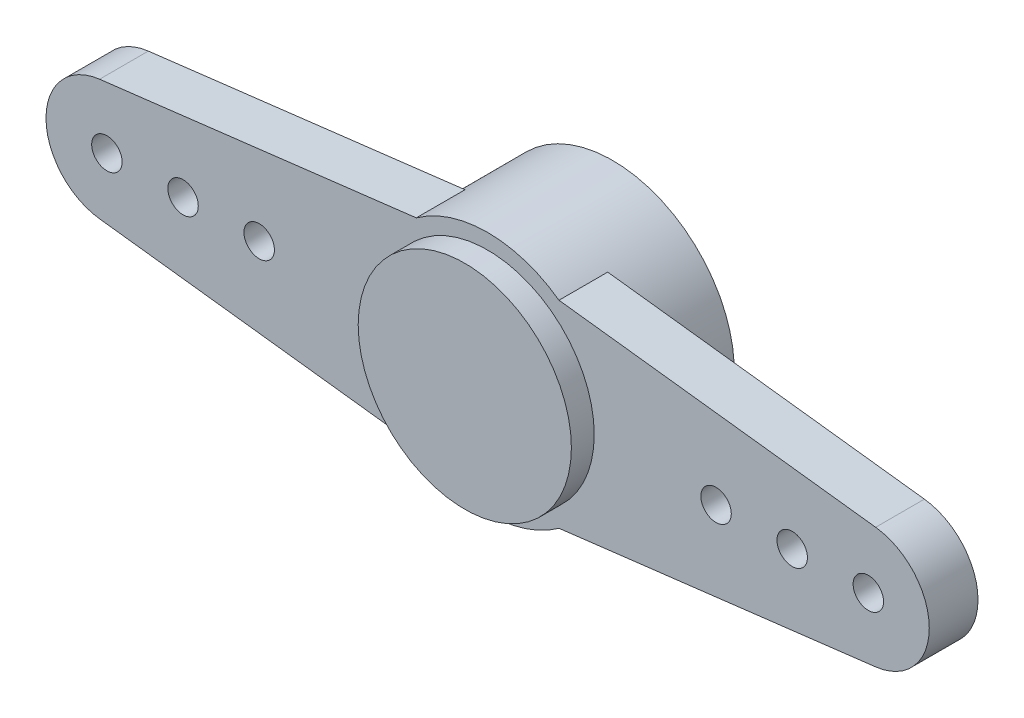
ISO-10303-21;
HEADER;
FILE_DESCRIPTION(('STEP AP214'),'2;1');
FILE_NAME('part.step','',(''),(''),'','','');
FILE_SCHEMA(('AUTOMOTIVE_DESIGN { 1 0 10303 214 1 1 1 1 }'));
ENDSEC;
DATA;
#1=APPLICATION_CONTEXT('core data for automotive mechanical design processes');
#2=APPLICATION_PROTOCOL_DEFINITION('international standard','automotive_design',2000,#1);
#3=PRODUCT_CONTEXT('',#1,'mechanical');
#4=PRODUCT('Part','Part','',(#3));
#5=PRODUCT_RELATED_PRODUCT_CATEGORY('part','',(#4));
#6=PRODUCT_DEFINITION_FORMATION('','',#4);
#7=PRODUCT_DEFINITION_CONTEXT('part definition',#1,'design');
#8=PRODUCT_DEFINITION('design','',#6,#7);
#9=PRODUCT_DEFINITION_SHAPE('','',#8);
#10=(LENGTH_UNIT() NAMED_UNIT(*) SI_UNIT(.MILLI.,.METRE.));
#11=(NAMED_UNIT(*) PLANE_ANGLE_UNIT() SI_UNIT($,.RADIAN.));
#12=(NAMED_UNIT(*) SI_UNIT($,.STERADIAN.) SOLID_ANGLE_UNIT());
#13=UNCERTAINTY_MEASURE_WITH_UNIT(LENGTH_MEASURE(1.E-05),#10,'distance_accuracy_value','');
#14=(GEOMETRIC_REPRESENTATION_CONTEXT(3) GLOBAL_UNCERTAINTY_ASSIGNED_CONTEXT((#13)) GLOBAL_UNIT_ASSIGNED_CONTEXT((#10,
#11,#12)) REPRESENTATION_CONTEXT('',''));
#15=CARTESIAN_POINT('',(0.,0.,0.));
#16=DIRECTION('',(0.,0.,1.));
#17=DIRECTION('',(1.,0.,0.));
#18=AXIS2_PLACEMENT_3D('',#15,#16,#17);
#19=CARTESIAN_POINT('',(0.,0.,0.));
#20=DIRECTION('',(0.,0.,1.));
#21=DIRECTION('',(1.,0.,0.));
#22=AXIS2_PLACEMENT_3D('',#19,#20,#21);
#23=PLANE('',#22);
#24=CARTESIAN_POINT('',(-10.,0.,0.));
#25=DIRECTION('',(0.,0.,1.));
#26=DIRECTION('',(1.,0.,0.));
#27=AXIS2_PLACEMENT_3D('',#24,#25,#26);
#28=CIRCLE('',#27,0.500000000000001);
#29=CARTESIAN_POINT('',(-9.5,0.,0.));
#30=VERTEX_POINT('',#29);
#31=EDGE_CURVE('E212',#30,#30,#28,.T.);
#32=ORIENTED_EDGE('',*,*,#31,.T.);
#33=EDGE_LOOP('',(#32));
#34=FACE_BOUND('',#33,.T.);
#35=CARTESIAN_POINT('',(-12.5,0.,0.));
#36=DIRECTION('',(0.,0.,1.));
#37=DIRECTION('',(1.,0.,0.));
#38=AXIS2_PLACEMENT_3D('',#35,#36,#37);
#39=CIRCLE('',#38,0.500000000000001);
#40=CARTESIAN_POINT('',(-12.,0.,0.));
#41=VERTEX_POINT('',#40);
#42=EDGE_CURVE('E218',#41,#41,#39,.T.);
#43=ORIENTED_EDGE('',*,*,#42,.T.);
#44=EDGE_LOOP('',(#43));
#45=FACE_BOUND('',#44,.T.);
#46=CARTESIAN_POINT('',(-7.5,0.,0.));
#47=DIRECTION('',(0.,0.,1.));
#48=DIRECTION('',(1.,0.,0.));
#49=AXIS2_PLACEMENT_3D('',#46,#47,#48);
#50=CIRCLE('',#49,0.500000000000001);
#51=CARTESIAN_POINT('',(-7.,0.,0.));
#52=VERTEX_POINT('',#51);
#53=EDGE_CURVE('E206',#52,#52,#50,.T.);
#54=ORIENTED_EDGE('',*,*,#53,.T.);
#55=EDGE_LOOP('',(#54));
#56=FACE_BOUND('',#55,.T.);
#57=DIRECTION('',(-0.992773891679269,-0.12,0.));
#58=VECTOR('',#57,1.);
#59=CARTESIAN_POINT('',(-12.74,1.98554778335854,0.));
#60=LINE('',#59,#58);
#61=CARTESIAN_POINT('',(-2.34249837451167,3.242329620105,0.));
#62=VERTEX_POINT('',#61);
#63=CARTESIAN_POINT('',(-12.74,1.98554778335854,0.));
#64=VERTEX_POINT('',#63);
#65=EDGE_CURVE('E134',#62,#64,#60,.T.);
#66=ORIENTED_EDGE('',*,*,#65,.F.);
#67=CARTESIAN_POINT('',(0.,0.,0.));
#68=DIRECTION('',(0.,0.,1.));
#69=DIRECTION('',(1.,0.,0.));
#70=AXIS2_PLACEMENT_3D('',#67,#68,#69);
#71=CIRCLE('',#70,4.);
#72=CARTESIAN_POINT('',(-2.34249837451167,-3.242329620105,0.));
#73=VERTEX_POINT('',#72);
#74=EDGE_CURVE('E120',#62,#73,#71,.T.);
#75=ORIENTED_EDGE('',*,*,#74,.T.);
#76=DIRECTION('',(0.992773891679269,-0.12,0.));
#77=VECTOR('',#76,1.);
#78=CARTESIAN_POINT('',(-12.74,-1.98554778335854,0.));
#79=LINE('',#78,#77);
#80=CARTESIAN_POINT('',(-12.74,-1.98554778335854,0.));
#81=VERTEX_POINT('',#80);
#82=EDGE_CURVE('E127',#81,#73,#79,.T.);
#83=ORIENTED_EDGE('',*,*,#82,.F.);
#84=CARTESIAN_POINT('',(-12.5,0.,0.));
#85=DIRECTION('',(0.,0.,1.));
#86=DIRECTION('',(1.,0.,0.));
#87=AXIS2_PLACEMENT_3D('',#84,#85,#86);
#88=CIRCLE('',#87,2.);
#89=EDGE_CURVE('E81',#64,#81,#88,.T.);
#90=ORIENTED_EDGE('',*,*,#89,.F.);
#91=EDGE_LOOP('',(#66,#75,#83,#90));
#92=FACE_BOUND('',#91,.T.);
#93=ADVANCED_FACE('F34',(#34,#45,#56,#92),#23,.F.);
#94=CARTESIAN_POINT('',(0.,0.,1.6));
#95=DIRECTION('',(0.,0.,1.));
#96=DIRECTION('',(1.,0.,0.));
#97=AXIS2_PLACEMENT_3D('',#94,#95,#96);
#98=PLANE('',#97);
#99=DIRECTION('',(-0.992773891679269,0.12,0.));
#100=VECTOR('',#99,1.);
#101=CARTESIAN_POINT('',(0.42,3.47470862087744,1.6));
#102=LINE('',#101,#100);
#103=CARTESIAN_POINT('',(12.74,1.98554778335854,1.6));
#104=VERTEX_POINT('',#103);
#105=CARTESIAN_POINT('',(2.34249837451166,3.242329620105,1.6));
#106=VERTEX_POINT('',#105);
#107=EDGE_CURVE('E128',#104,#106,#102,.T.);
#108=ORIENTED_EDGE('',*,*,#107,.T.);
#109=CARTESIAN_POINT('',(0.,0.,1.6));
#110=DIRECTION('',(0.,0.,1.));
#111=DIRECTION('',(1.,0.,0.));
#112=AXIS2_PLACEMENT_3D('',#109,#110,#111);
#113=CIRCLE('',#112,4.);
#114=CARTESIAN_POINT('',(-2.34249837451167,3.242329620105,1.6));
#115=VERTEX_POINT('',#114);
#116=EDGE_CURVE('E121',#115,#106,#113,.F.);
#117=ORIENTED_EDGE('',*,*,#116,.F.);
#118=DIRECTION('',(-0.992773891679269,-0.12,0.));
#119=VECTOR('',#118,1.);
#120=CARTESIAN_POINT('',(-12.74,1.98554778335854,1.6));
#121=LINE('',#120,#119);
#122=CARTESIAN_POINT('',(-12.74,1.98554778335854,1.6));
#123=VERTEX_POINT('',#122);
#124=EDGE_CURVE('E149',#115,#123,#121,.T.);
#125=ORIENTED_EDGE('',*,*,#124,.T.);
#126=CARTESIAN_POINT('',(-12.5,0.,1.6));
#127=DIRECTION('',(0.,0.,1.));
#128=DIRECTION('',(1.,0.,0.));
#129=AXIS2_PLACEMENT_3D('',#126,#127,#128);
#130=CIRCLE('',#129,2.);
#131=CARTESIAN_POINT('',(-12.74,-1.98554778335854,1.6));
#132=VERTEX_POINT('',#131);
#133=EDGE_CURVE('E60',#123,#132,#130,.T.);
#134=ORIENTED_EDGE('',*,*,#133,.T.);
#135=DIRECTION('',(0.992773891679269,-0.12,0.));
#136=VECTOR('',#135,1.);
#137=CARTESIAN_POINT('',(-12.74,-1.98554778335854,1.6));
#138=LINE('',#137,#136);
#139=CARTESIAN_POINT('',(-2.34249837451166,-3.242329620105,1.6));
#140=VERTEX_POINT('',#139);
#141=EDGE_CURVE('E119',#132,#140,#138,.T.);
#142=ORIENTED_EDGE('',*,*,#141,.T.);
#143=CARTESIAN_POINT('',(2.34249837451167,-3.242329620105,1.6));
#144=VERTEX_POINT('',#143);
#145=EDGE_CURVE('E52',#144,#140,#113,.F.);
#146=ORIENTED_EDGE('',*,*,#145,.F.);
#147=DIRECTION('',(0.992773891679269,0.12,0.));
#148=VECTOR('',#147,1.);
#149=CARTESIAN_POINT('',(12.74,-1.98554778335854,1.6));
#150=LINE('',#149,#148);
#151=CARTESIAN_POINT('',(12.74,-1.98554778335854,1.6));
#152=VERTEX_POINT('',#151);
#153=EDGE_CURVE('E38',#144,#152,#150,.T.);
#154=ORIENTED_EDGE('',*,*,#153,.T.);
#155=CARTESIAN_POINT('',(12.5,0.,1.6));
#156=DIRECTION('',(0.,0.,1.));
#157=DIRECTION('',(1.,0.,0.));
#158=AXIS2_PLACEMENT_3D('',#155,#156,#157);
#159=CIRCLE('',#158,2.);
#160=EDGE_CURVE('E126',#152,#104,#159,.T.);
#161=ORIENTED_EDGE('',*,*,#160,.T.);
#162=EDGE_LOOP('',(#108,#117,#125,#134,#142,#146,#154,#161));
#163=FACE_BOUND('',#162,.T.);
#164=CARTESIAN_POINT('',(10.,0.,1.6));
#165=DIRECTION('',(0.,0.,1.));
#166=DIRECTION('',(1.,0.,0.));
#167=AXIS2_PLACEMENT_3D('',#164,#165,#166);
#168=CIRCLE('',#167,0.500000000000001);
#169=CARTESIAN_POINT('',(10.5,0.,1.6));
#170=VERTEX_POINT('',#169);
#171=EDGE_CURVE('E197',#170,#170,#168,.T.);
#172=ORIENTED_EDGE('',*,*,#171,.F.);
#173=EDGE_LOOP('',(#172));
#174=FACE_BOUND('',#173,.T.);
#175=CARTESIAN_POINT('',(7.5,0.,1.6));
#176=DIRECTION('',(0.,0.,1.));
#177=DIRECTION('',(1.,0.,0.));
#178=AXIS2_PLACEMENT_3D('',#175,#176,#177);
#179=CIRCLE('',#178,0.500000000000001);
#180=CARTESIAN_POINT('',(8.,0.,1.6));
#181=VERTEX_POINT('',#180);
#182=EDGE_CURVE('E203',#181,#181,#179,.T.);
#183=ORIENTED_EDGE('',*,*,#182,.F.);
#184=EDGE_LOOP('',(#183));
#185=FACE_BOUND('',#184,.T.);
#186=CARTESIAN_POINT('',(12.5,0.,1.6));
#187=DIRECTION('',(0.,0.,1.));
#188=DIRECTION('',(1.,0.,0.));
#189=AXIS2_PLACEMENT_3D('',#186,#187,#188);
#190=CIRCLE('',#189,0.500000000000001);
#191=CARTESIAN_POINT('',(13.,0.,1.6));
#192=VERTEX_POINT('',#191);
#193=EDGE_CURVE('E191',#192,#192,#190,.T.);
#194=ORIENTED_EDGE('',*,*,#193,.F.);
#195=EDGE_LOOP('',(#194));
#196=FACE_BOUND('',#195,.T.);
#197=CARTESIAN_POINT('',(0.,0.,1.6));
#198=DIRECTION('',(0.,0.,1.));
#199=DIRECTION('',(1.,0.,0.));
#200=AXIS2_PLACEMENT_3D('',#197,#198,#199);
#201=CIRCLE('',#200,3.5);
#202=CARTESIAN_POINT('',(3.5,0.,1.6));
#203=VERTEX_POINT('',#202);
#204=EDGE_CURVE('E44',#203,#203,#201,.T.);
#205=ORIENTED_EDGE('',*,*,#204,.F.);
#206=EDGE_LOOP('',(#205));
#207=FACE_BOUND('',#206,.T.);
#208=CARTESIAN_POINT('',(-10.,0.,1.6));
#209=DIRECTION('',(0.,0.,1.));
#210=DIRECTION('',(1.,0.,0.));
#211=AXIS2_PLACEMENT_3D('',#208,#209,#210);
#212=CIRCLE('',#211,0.500000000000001);
#213=CARTESIAN_POINT('',(-9.5,0.,1.6));
#214=VERTEX_POINT('',#213);
#215=EDGE_CURVE('E215',#214,#214,#212,.T.);
#216=ORIENTED_EDGE('',*,*,#215,.F.);
#217=EDGE_LOOP('',(#216));
#218=FACE_BOUND('',#217,.T.);
#219=CARTESIAN_POINT('',(-12.5,0.,1.6));
#220=DIRECTION('',(0.,0.,1.));
#221=DIRECTION('',(1.,0.,0.));
#222=AXIS2_PLACEMENT_3D('',#219,#220,#221);
#223=CIRCLE('',#222,0.500000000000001);
#224=CARTESIAN_POINT('',(-12.,0.,1.6));
#225=VERTEX_POINT('',#224);
#226=EDGE_CURVE('E166',#225,#225,#223,.T.);
#227=ORIENTED_EDGE('',*,*,#226,.F.);
#228=EDGE_LOOP('',(#227));
#229=FACE_BOUND('',#228,.T.);
#230=CARTESIAN_POINT('',(-7.5,0.,1.6));
#231=DIRECTION('',(0.,0.,1.));
#232=DIRECTION('',(1.,0.,0.));
#233=AXIS2_PLACEMENT_3D('',#230,#231,#232);
#234=CIRCLE('',#233,0.500000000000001);
#235=CARTESIAN_POINT('',(-7.,0.,1.6));
#236=VERTEX_POINT('',#235);
#237=EDGE_CURVE('E209',#236,#236,#234,.T.);
#238=ORIENTED_EDGE('',*,*,#237,.F.);
#239=EDGE_LOOP('',(#238));
#240=FACE_BOUND('',#239,.T.);
#241=ADVANCED_FACE('F116',(#163,#174,#185,#196,#207,#218,#229,#240),#98,.T.);
#242=CARTESIAN_POINT('',(10.,0.,0.));
#243=DIRECTION('',(0.,0.,1.));
#244=DIRECTION('',(1.,0.,0.));
#245=AXIS2_PLACEMENT_3D('',#242,#243,#244);
#246=CIRCLE('',#245,0.500000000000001);
#247=CARTESIAN_POINT('',(10.5,0.,0.));
#248=VERTEX_POINT('',#247);
#249=EDGE_CURVE('E194',#248,#248,#246,.T.);
#250=ORIENTED_EDGE('',*,*,#249,.T.);
#251=EDGE_LOOP('',(#250));
#252=FACE_BOUND('',#251,.T.);
#253=DIRECTION('',(0.992773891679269,0.12,0.));
#254=VECTOR('',#253,1.);
#255=CARTESIAN_POINT('',(12.74,-1.98554778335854,0.));
#256=LINE('',#255,#254);
#257=CARTESIAN_POINT('',(2.34249837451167,-3.242329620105,0.));
#258=VERTEX_POINT('',#257);
#259=CARTESIAN_POINT('',(12.74,-1.98554778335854,0.));
#260=VERTEX_POINT('',#259);
#261=EDGE_CURVE('E163',#258,#260,#256,.T.);
#262=ORIENTED_EDGE('',*,*,#261,.F.);
#263=CARTESIAN_POINT('',(2.34249837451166,3.242329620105,0.));
#264=VERTEX_POINT('',#263);
#265=EDGE_CURVE('E110',#258,#264,#71,.T.);
#266=ORIENTED_EDGE('',*,*,#265,.T.);
#267=DIRECTION('',(-0.992773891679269,0.12,0.));
#268=VECTOR('',#267,1.);
#269=CARTESIAN_POINT('',(0.42,3.47470862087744,0.));
#270=LINE('',#269,#268);
#271=CARTESIAN_POINT('',(12.74,1.98554778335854,0.));
#272=VERTEX_POINT('',#271);
#273=EDGE_CURVE('E168',#272,#264,#270,.T.);
#274=ORIENTED_EDGE('',*,*,#273,.F.);
#275=CARTESIAN_POINT('',(12.5,0.,0.));
#276=DIRECTION('',(0.,0.,1.));
#277=DIRECTION('',(1.,0.,0.));
#278=AXIS2_PLACEMENT_3D('',#275,#276,#277);
#279=CIRCLE('',#278,2.);
#280=EDGE_CURVE('E165',#260,#272,#279,.T.);
#281=ORIENTED_EDGE('',*,*,#280,.F.);
#282=EDGE_LOOP('',(#262,#266,#274,#281));
#283=FACE_BOUND('',#282,.T.);
#284=CARTESIAN_POINT('',(7.5,0.,0.));
#285=DIRECTION('',(0.,0.,1.));
#286=DIRECTION('',(1.,0.,0.));
#287=AXIS2_PLACEMENT_3D('',#284,#285,#286);
#288=CIRCLE('',#287,0.500000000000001);
#289=CARTESIAN_POINT('',(8.,0.,0.));
#290=VERTEX_POINT('',#289);
#291=EDGE_CURVE('E200',#290,#290,#288,.T.);
#292=ORIENTED_EDGE('',*,*,#291,.T.);
#293=EDGE_LOOP('',(#292));
#294=FACE_BOUND('',#293,.T.);
#295=CARTESIAN_POINT('',(12.5,0.,0.));
#296=DIRECTION('',(0.,0.,1.));
#297=DIRECTION('',(1.,0.,0.));
#298=AXIS2_PLACEMENT_3D('',#295,#296,#297);
#299=CIRCLE('',#298,0.500000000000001);
#300=CARTESIAN_POINT('',(13.,0.,0.));
#301=VERTEX_POINT('',#300);
#302=EDGE_CURVE('E190',#301,#301,#299,.T.);
#303=ORIENTED_EDGE('',*,*,#302,.T.);
#304=EDGE_LOOP('',(#303));
#305=FACE_BOUND('',#304,.T.);
#306=ADVANCED_FACE('F245',(#252,#283,#294,#305),#23,.F.);
#307=CARTESIAN_POINT('',(12.74,-1.98554778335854,1.6));
#308=DIRECTION('',(-0.12,0.992773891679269,0.));
#309=DIRECTION('',(-0.992773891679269,-0.12,0.));
#310=AXIS2_PLACEMENT_3D('',#307,#308,#309);
#311=PLANE('',#310);
#312=ORIENTED_EDGE('',*,*,#153,.F.);
#313=DIRECTION('',(0.,0.,-1.));
#314=VECTOR('',#313,1.);
#315=CARTESIAN_POINT('',(2.34249837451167,-3.242329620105,12.9137084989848));
#316=LINE('',#315,#314);
#317=EDGE_CURVE('E107',#144,#258,#316,.T.);
#318=ORIENTED_EDGE('',*,*,#317,.T.);
#319=ORIENTED_EDGE('',*,*,#261,.T.);
#320=DIRECTION('',(0.,0.,-1.));
#321=VECTOR('',#320,1.);
#322=CARTESIAN_POINT('',(12.74,-1.98554778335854,1.6));
#323=LINE('',#322,#321);
#324=EDGE_CURVE('E124',#152,#260,#323,.T.);
#325=ORIENTED_EDGE('',*,*,#324,.F.);
#326=EDGE_LOOP('',(#312,#318,#319,#325));
#327=FACE_BOUND('',#326,.T.);
#328=ADVANCED_FACE('F36',(#327),#311,.F.);
#329=CARTESIAN_POINT('',(12.5,0.,1.6));
#330=DIRECTION('',(0.,0.,-1.));
#331=DIRECTION('',(-1.,0.,0.));
#332=AXIS2_PLACEMENT_3D('',#329,#330,#331);
#333=CYLINDRICAL_SURFACE('',#332,2.);
#334=ORIENTED_EDGE('',*,*,#280,.T.);
#335=DIRECTION('',(0.,0.,-1.));
#336=VECTOR('',#335,1.);
#337=CARTESIAN_POINT('',(12.74,1.98554778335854,1.6));
#338=LINE('',#337,#336);
#339=EDGE_CURVE('E142',#104,#272,#338,.T.);
#340=ORIENTED_EDGE('',*,*,#339,.F.);
#341=ORIENTED_EDGE('',*,*,#160,.F.);
#342=ORIENTED_EDGE('',*,*,#324,.T.);
#343=EDGE_LOOP('',(#334,#340,#341,#342));
#344=FACE_BOUND('',#343,.T.);
#345=ADVANCED_FACE('F254',(#344),#333,.T.);
#346=CARTESIAN_POINT('',(0.42,3.47470862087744,1.6));
#347=DIRECTION('',(-0.12,-0.992773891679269,0.));
#348=DIRECTION('',(0.992773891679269,-0.12,0.));
#349=AXIS2_PLACEMENT_3D('',#346,#347,#348);
#350=PLANE('',#349);
#351=ORIENTED_EDGE('',*,*,#273,.T.);
#352=DIRECTION('',(0.,0.,-1.));
#353=VECTOR('',#352,1.);
#354=CARTESIAN_POINT('',(2.34249837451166,3.242329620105,12.9137084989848));
#355=LINE('',#354,#353);
#356=EDGE_CURVE('E179',#264,#106,#355,.F.);
#357=ORIENTED_EDGE('',*,*,#356,.T.);
#358=ORIENTED_EDGE('',*,*,#107,.F.);
#359=ORIENTED_EDGE('',*,*,#339,.T.);
#360=EDGE_LOOP('',(#351,#357,#358,#359));
#361=FACE_BOUND('',#360,.T.);
#362=ADVANCED_FACE('F342',(#361),#350,.F.);
#363=CARTESIAN_POINT('',(0.,0.,1.6));
#364=DIRECTION('',(0.,0.,-1.));
#365=DIRECTION('',(-1.,0.,0.));
#366=AXIS2_PLACEMENT_3D('',#363,#364,#365);
#367=CYLINDRICAL_SURFACE('',#366,3.5);
#368=ORIENTED_EDGE('',*,*,#204,.T.);
#369=EDGE_LOOP('',(#368));
#370=FACE_BOUND('',#369,.T.);
#371=CARTESIAN_POINT('',(0.,0.,2.35));
#372=DIRECTION('',(0.,0.,1.));
#373=DIRECTION('',(1.,0.,0.));
#374=AXIS2_PLACEMENT_3D('',#371,#372,#373);
#375=CIRCLE('',#374,3.5);
#376=CARTESIAN_POINT('',(3.5,0.,2.35));
#377=VERTEX_POINT('',#376);
#378=EDGE_CURVE('E113',#377,#377,#375,.T.);
#379=ORIENTED_EDGE('',*,*,#378,.F.);
#380=EDGE_LOOP('',(#379));
#381=FACE_BOUND('',#380,.T.);
#382=ADVANCED_FACE('F347',(#370,#381),#367,.T.);
#383=CARTESIAN_POINT('',(-12.74,1.98554778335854,1.6));
#384=DIRECTION('',(0.12,-0.992773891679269,0.));
#385=DIRECTION('',(0.992773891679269,0.12,0.));
#386=AXIS2_PLACEMENT_3D('',#383,#384,#385);
#387=PLANE('',#386);
#388=ORIENTED_EDGE('',*,*,#124,.F.);
#389=DIRECTION('',(0.,0.,-1.));
#390=VECTOR('',#389,1.);
#391=CARTESIAN_POINT('',(-2.34249837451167,3.242329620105,12.9137084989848));
#392=LINE('',#391,#390);
#393=EDGE_CURVE('E174',#115,#62,#392,.T.);
#394=ORIENTED_EDGE('',*,*,#393,.T.);
#395=ORIENTED_EDGE('',*,*,#65,.T.);
#396=DIRECTION('',(0.,0.,-1.));
#397=VECTOR('',#396,1.);
#398=CARTESIAN_POINT('',(-12.74,1.98554778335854,1.6));
#399=LINE('',#398,#397);
#400=EDGE_CURVE('E140',#123,#64,#399,.T.);
#401=ORIENTED_EDGE('',*,*,#400,.F.);
#402=EDGE_LOOP('',(#388,#394,#395,#401));
#403=FACE_BOUND('',#402,.T.);
#404=ADVANCED_FACE('F173',(#403),#387,.F.);
#405=CARTESIAN_POINT('',(-12.5,0.,1.6));
#406=DIRECTION('',(0.,0.,-1.));
#407=DIRECTION('',(-1.,0.,0.));
#408=AXIS2_PLACEMENT_3D('',#405,#406,#407);
#409=CYLINDRICAL_SURFACE('',#408,2.);
#410=ORIENTED_EDGE('',*,*,#89,.T.);
#411=DIRECTION('',(0.,0.,-1.));
#412=VECTOR('',#411,1.);
#413=CARTESIAN_POINT('',(-12.74,-1.98554778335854,1.6));
#414=LINE('',#413,#412);
#415=EDGE_CURVE('E138',#132,#81,#414,.T.);
#416=ORIENTED_EDGE('',*,*,#415,.F.);
#417=ORIENTED_EDGE('',*,*,#133,.F.);
#418=ORIENTED_EDGE('',*,*,#400,.T.);
#419=EDGE_LOOP('',(#410,#416,#417,#418));
#420=FACE_BOUND('',#419,.T.);
#421=ADVANCED_FACE('F177',(#420),#409,.T.);
#422=CARTESIAN_POINT('',(-12.74,-1.98554778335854,1.6));
#423=DIRECTION('',(0.12,0.992773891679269,0.));
#424=DIRECTION('',(-0.992773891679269,0.12,0.));
#425=AXIS2_PLACEMENT_3D('',#422,#423,#424);
#426=PLANE('',#425);
#427=ORIENTED_EDGE('',*,*,#82,.T.);
#428=DIRECTION('',(0.,0.,-1.));
#429=VECTOR('',#428,1.);
#430=CARTESIAN_POINT('',(-2.34249837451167,-3.242329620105,12.9137084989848));
#431=LINE('',#430,#429);
#432=EDGE_CURVE('E11',#73,#140,#431,.F.);
#433=ORIENTED_EDGE('',*,*,#432,.T.);
#434=ORIENTED_EDGE('',*,*,#141,.F.);
#435=ORIENTED_EDGE('',*,*,#415,.T.);
#436=EDGE_LOOP('',(#427,#433,#434,#435));
#437=FACE_BOUND('',#436,.T.);
#438=ADVANCED_FACE('F230',(#437),#426,.F.);
#439=CARTESIAN_POINT('',(-12.5,0.,1.6));
#440=DIRECTION('',(0.,0.,-1.));
#441=DIRECTION('',(-1.,0.,0.));
#442=AXIS2_PLACEMENT_3D('',#439,#440,#441);
#443=CYLINDRICAL_SURFACE('',#442,0.500000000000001);
#444=ORIENTED_EDGE('',*,*,#226,.T.);
#445=EDGE_LOOP('',(#444));
#446=FACE_BOUND('',#445,.T.);
#447=ORIENTED_EDGE('',*,*,#42,.F.);
#448=EDGE_LOOP('',(#447));
#449=FACE_BOUND('',#448,.T.);
#450=ADVANCED_FACE('F227',(#446,#449),#443,.F.);
#451=CARTESIAN_POINT('',(-10.,0.,1.6));
#452=DIRECTION('',(0.,0.,-1.));
#453=DIRECTION('',(-1.,0.,0.));
#454=AXIS2_PLACEMENT_3D('',#451,#452,#453);
#455=CYLINDRICAL_SURFACE('',#454,0.500000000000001);
#456=ORIENTED_EDGE('',*,*,#215,.T.);
#457=EDGE_LOOP('',(#456));
#458=FACE_BOUND('',#457,.T.);
#459=ORIENTED_EDGE('',*,*,#31,.F.);
#460=EDGE_LOOP('',(#459));
#461=FACE_BOUND('',#460,.T.);
#462=ADVANCED_FACE('F229',(#458,#461),#455,.F.);
#463=CARTESIAN_POINT('',(-7.5,0.,1.6));
#464=DIRECTION('',(0.,0.,-1.));
#465=DIRECTION('',(-1.,0.,0.));
#466=AXIS2_PLACEMENT_3D('',#463,#464,#465);
#467=CYLINDRICAL_SURFACE('',#466,0.500000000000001);
#468=ORIENTED_EDGE('',*,*,#237,.T.);
#469=EDGE_LOOP('',(#468));
#470=FACE_BOUND('',#469,.T.);
#471=ORIENTED_EDGE('',*,*,#53,.F.);
#472=EDGE_LOOP('',(#471));
#473=FACE_BOUND('',#472,.T.);
#474=ADVANCED_FACE('F237',(#470,#473),#467,.F.);
#475=CARTESIAN_POINT('',(7.5,0.,1.6));
#476=DIRECTION('',(0.,0.,-1.));
#477=DIRECTION('',(-1.,0.,0.));
#478=AXIS2_PLACEMENT_3D('',#475,#476,#477);
#479=CYLINDRICAL_SURFACE('',#478,0.500000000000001);
#480=ORIENTED_EDGE('',*,*,#182,.T.);
#481=EDGE_LOOP('',(#480));
#482=FACE_BOUND('',#481,.T.);
#483=ORIENTED_EDGE('',*,*,#291,.F.);
#484=EDGE_LOOP('',(#483));
#485=FACE_BOUND('',#484,.T.);
#486=ADVANCED_FACE('F274',(#482,#485),#479,.F.);
#487=CARTESIAN_POINT('',(10.,0.,1.6));
#488=DIRECTION('',(0.,0.,-1.));
#489=DIRECTION('',(-1.,0.,0.));
#490=AXIS2_PLACEMENT_3D('',#487,#488,#489);
#491=CYLINDRICAL_SURFACE('',#490,0.500000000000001);
#492=ORIENTED_EDGE('',*,*,#171,.T.);
#493=EDGE_LOOP('',(#492));
#494=FACE_BOUND('',#493,.T.);
#495=ORIENTED_EDGE('',*,*,#249,.F.);
#496=EDGE_LOOP('',(#495));
#497=FACE_BOUND('',#496,.T.);
#498=ADVANCED_FACE('F265',(#494,#497),#491,.F.);
#499=CARTESIAN_POINT('',(12.5,0.,1.6));
#500=DIRECTION('',(0.,0.,-1.));
#501=DIRECTION('',(-1.,0.,0.));
#502=AXIS2_PLACEMENT_3D('',#499,#500,#501);
#503=CYLINDRICAL_SURFACE('',#502,0.500000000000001);
#504=ORIENTED_EDGE('',*,*,#193,.T.);
#505=EDGE_LOOP('',(#504));
#506=FACE_BOUND('',#505,.T.);
#507=ORIENTED_EDGE('',*,*,#302,.F.);
#508=EDGE_LOOP('',(#507));
#509=FACE_BOUND('',#508,.T.);
#510=ADVANCED_FACE('F262',(#506,#509),#503,.F.);
#511=CARTESIAN_POINT('',(0.,0.,2.35));
#512=DIRECTION('',(0.,0.,1.));
#513=DIRECTION('',(1.,0.,0.));
#514=AXIS2_PLACEMENT_3D('',#511,#512,#513);
#515=PLANE('',#514);
#516=ORIENTED_EDGE('',*,*,#378,.T.);
#517=EDGE_LOOP('',(#516));
#518=FACE_BOUND('',#517,.T.);
#519=ADVANCED_FACE('F264',(#518),#515,.T.);
#520=CARTESIAN_POINT('',(0.,0.,12.9137084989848));
#521=DIRECTION('',(0.,0.,-1.));
#522=DIRECTION('',(-1.,0.,0.));
#523=AXIS2_PLACEMENT_3D('',#520,#521,#522);
#524=CYLINDRICAL_SURFACE('',#523,4.);
#525=CARTESIAN_POINT('',(0.,0.,-2.5));
#526=DIRECTION('',(0.,0.,-1.));
#527=DIRECTION('',(-1.,0.,0.));
#528=AXIS2_PLACEMENT_3D('',#525,#526,#527);
#529=CIRCLE('',#528,4.);
#530=CARTESIAN_POINT('',(-4.,0.,-2.5));
#531=VERTEX_POINT('',#530);
#532=EDGE_CURVE('E416',#531,#531,#529,.T.);
#533=ORIENTED_EDGE('',*,*,#532,.F.);
#534=EDGE_LOOP('',(#533));
#535=FACE_BOUND('',#534,.T.);
#536=ORIENTED_EDGE('',*,*,#317,.F.);
#537=ORIENTED_EDGE('',*,*,#145,.T.);
#538=ORIENTED_EDGE('',*,*,#432,.F.);
#539=ORIENTED_EDGE('',*,*,#74,.F.);
#540=ORIENTED_EDGE('',*,*,#393,.F.);
#541=ORIENTED_EDGE('',*,*,#116,.T.);
#542=ORIENTED_EDGE('',*,*,#356,.F.);
#543=ORIENTED_EDGE('',*,*,#265,.F.);
#544=EDGE_LOOP('',(#536,#537,#538,#539,#540,#541,#542,#543));
#545=FACE_BOUND('',#544,.T.);
#546=ADVANCED_FACE('F108',(#535,#545),#524,.T.);
#547=CARTESIAN_POINT('',(0.,0.,-2.5));
#548=DIRECTION('',(0.,0.,-1.));
#549=DIRECTION('',(-1.,0.,0.));
#550=AXIS2_PLACEMENT_3D('',#547,#548,#549);
#551=PLANE('',#550);
#552=CARTESIAN_POINT('',(0.,0.,-2.5));
#553=DIRECTION('',(0.,0.,-1.));
#554=DIRECTION('',(-1.,0.,0.));
#555=AXIS2_PLACEMENT_3D('',#552,#553,#554);
#556=CIRCLE('',#555,2.9);
#557=CARTESIAN_POINT('',(-2.9,0.,-2.5));
#558=VERTEX_POINT('',#557);
#559=EDGE_CURVE('E417',#558,#558,#556,.T.);
#560=ORIENTED_EDGE('',*,*,#559,.F.);
#561=EDGE_LOOP('',(#560));
#562=FACE_BOUND('',#561,.T.);
#563=ORIENTED_EDGE('',*,*,#532,.T.);
#564=EDGE_LOOP('',(#563));
#565=FACE_BOUND('',#564,.T.);
#566=ADVANCED_FACE('F380',(#562,#565),#551,.T.);
#567=CARTESIAN_POINT('',(0.,0.,0.2));
#568=DIRECTION('',(0.,0.,-1.));
#569=DIRECTION('',(-1.,0.,0.));
#570=AXIS2_PLACEMENT_3D('',#567,#568,#569);
#571=CYLINDRICAL_SURFACE('',#570,2.9);
#572=CARTESIAN_POINT('',(0.,0.,0.2));
#573=DIRECTION('',(0.,0.,-1.));
#574=DIRECTION('',(-1.,0.,0.));
#575=AXIS2_PLACEMENT_3D('',#572,#573,#574);
#576=CIRCLE('',#575,2.9);
#577=CARTESIAN_POINT('',(-2.9,0.,0.2));
#578=VERTEX_POINT('',#577);
#579=EDGE_CURVE('E415',#578,#578,#576,.T.);
#580=CARTESIAN_POINT('',(-2.9,0.,0.2));
#581=CARTESIAN_POINT('',(-2.9,0.,0.171875));
#582=CARTESIAN_POINT('',(-2.9,0.,0.14375));
#583=CARTESIAN_POINT('',(-2.9,0.,0.0875000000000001));
#584=CARTESIAN_POINT('',(-2.9,0.,0.0593750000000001));
#585=CARTESIAN_POINT('',(-2.9,0.,0.00312500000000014));
#586=CARTESIAN_POINT('',(-2.9,0.,-0.0249999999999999));
#587=CARTESIAN_POINT('',(-2.9,0.,-0.0812499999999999));
#588=CARTESIAN_POINT('',(-2.9,0.,-0.109375));
#589=CARTESIAN_POINT('',(-2.9,0.,-0.165625));
#590=CARTESIAN_POINT('',(-2.9,0.,-0.19375));
#591=CARTESIAN_POINT('',(-2.9,0.,-0.25));
#592=CARTESIAN_POINT('',(-2.9,0.,-0.278125));
#593=CARTESIAN_POINT('',(-2.9,0.,-0.334375));
#594=CARTESIAN_POINT('',(-2.9,0.,-0.3625));
#595=CARTESIAN_POINT('',(-2.9,0.,-0.41875));
#596=CARTESIAN_POINT('',(-2.9,0.,-0.446875));
#597=CARTESIAN_POINT('',(-2.9,0.,-0.503125));
#598=CARTESIAN_POINT('',(-2.9,0.,-0.53125));
#599=CARTESIAN_POINT('',(-2.9,0.,-0.5875));
#600=CARTESIAN_POINT('',(-2.9,0.,-0.615625));
#601=CARTESIAN_POINT('',(-2.9,0.,-0.671875));
#602=CARTESIAN_POINT('',(-2.9,0.,-0.7));
#603=CARTESIAN_POINT('',(-2.9,0.,-0.75625));
#604=CARTESIAN_POINT('',(-2.9,0.,-0.784375));
#605=CARTESIAN_POINT('',(-2.9,0.,-0.840625));
#606=CARTESIAN_POINT('',(-2.9,0.,-0.86875));
#607=CARTESIAN_POINT('',(-2.9,0.,-0.925));
#608=CARTESIAN_POINT('',(-2.9,0.,-0.953125));
#609=CARTESIAN_POINT('',(-2.9,0.,-1.009375));
#610=CARTESIAN_POINT('',(-2.9,0.,-1.0375));
#611=CARTESIAN_POINT('',(-2.9,0.,-1.09375));
#612=CARTESIAN_POINT('',(-2.9,0.,-1.121875));
#613=CARTESIAN_POINT('',(-2.9,0.,-1.178125));
#614=CARTESIAN_POINT('',(-2.9,0.,-1.20625));
#615=CARTESIAN_POINT('',(-2.9,0.,-1.2625));
#616=CARTESIAN_POINT('',(-2.9,0.,-1.290625));
#617=CARTESIAN_POINT('',(-2.9,0.,-1.346875));
#618=CARTESIAN_POINT('',(-2.9,0.,-1.375));
#619=CARTESIAN_POINT('',(-2.9,0.,-1.43125));
#620=CARTESIAN_POINT('',(-2.9,0.,-1.459375));
#621=CARTESIAN_POINT('',(-2.9,0.,-1.515625));
#622=CARTESIAN_POINT('',(-2.9,0.,-1.54375));
#623=CARTESIAN_POINT('',(-2.9,0.,-1.6));
#624=CARTESIAN_POINT('',(-2.9,0.,-1.628125));
#625=CARTESIAN_POINT('',(-2.9,0.,-1.684375));
#626=CARTESIAN_POINT('',(-2.9,0.,-1.7125));
#627=CARTESIAN_POINT('',(-2.9,0.,-1.76875));
#628=CARTESIAN_POINT('',(-2.9,0.,-1.796875));
#629=CARTESIAN_POINT('',(-2.9,0.,-1.853125));
#630=CARTESIAN_POINT('',(-2.9,0.,-1.88125));
#631=CARTESIAN_POINT('',(-2.9,0.,-1.9375));
#632=CARTESIAN_POINT('',(-2.9,0.,-1.965625));
#633=CARTESIAN_POINT('',(-2.9,0.,-2.021875));
#634=CARTESIAN_POINT('',(-2.9,0.,-2.05));
#635=CARTESIAN_POINT('',(-2.9,0.,-2.10625));
#636=CARTESIAN_POINT('',(-2.9,0.,-2.134375));
#637=CARTESIAN_POINT('',(-2.9,0.,-2.190625));
#638=CARTESIAN_POINT('',(-2.9,0.,-2.21875));
#639=CARTESIAN_POINT('',(-2.9,0.,-2.275));
#640=CARTESIAN_POINT('',(-2.9,0.,-2.303125));
#641=CARTESIAN_POINT('',(-2.9,0.,-2.359375));
#642=CARTESIAN_POINT('',(-2.9,0.,-2.3875));
#643=CARTESIAN_POINT('',(-2.9,0.,-2.44375));
#644=CARTESIAN_POINT('',(-2.9,0.,-2.471875));
#645=CARTESIAN_POINT('',(-2.9,0.,-2.5));
#646=B_SPLINE_CURVE_WITH_KNOTS('',3,(#580,#581,#582,#583,#584,#585,#586,#587,#588,#589,#590,
#591,#592,#593,#594,#595,#596,#597,#598,#599,#600,#601,#602,#603,#604,#605,#606,#607,#608,#609,
#610,#611,#612,#613,#614,#615,#616,#617,#618,#619,#620,#621,#622,#623,#624,#625,#626,#627,#628,
#629,#630,#631,#632,#633,#634,#635,#636,#637,#638,#639,#640,#641,#642,#643,#644,#645),
.UNSPECIFIED.,.F.,.F.,(4,2,2,2,2,2,2,2,2,2,2,2,2,2,2,2,2,2,2,2,2,2,2,2,2,2,2,2,2,2,2,2,4),(0.,
0.084375,0.16875,0.253125,0.3375,0.421875,0.50625,0.590625,0.675,0.759375,0.84375,0.928125,
1.0125,1.096875,1.18125,1.265625,1.35,1.434375,1.51875,1.603125,1.6875,1.771875,1.85625,
1.940625,2.025,2.109375,2.19375,2.278125,2.3625,2.446875,2.53125,2.615625,2.7),.UNSPECIFIED.);
#647=EDGE_CURVE('BSEAM389',#578,#558,#646,.T.);
#648=ORIENTED_EDGE('',*,*,#579,.F.);
#649=ORIENTED_EDGE('',*,*,#559,.T.);
#650=ORIENTED_EDGE('',*,*,#647,.T.);
#651=ORIENTED_EDGE('',*,*,#647,.F.);
#652=EDGE_LOOP('',(#648,#650,#649,#651));
#653=FACE_BOUND('',#652,.T.);
#654=ADVANCED_FACE('F389',(#653),#571,.F.);
#655=CARTESIAN_POINT('',(0.,0.,0.2));
#656=DIRECTION('',(0.,0.,-1.));
#657=DIRECTION('',(-1.,0.,0.));
#658=AXIS2_PLACEMENT_3D('',#655,#656,#657);
#659=PLANE('',#658);
#660=ORIENTED_EDGE('',*,*,#579,.T.);
#661=EDGE_LOOP('',(#660));
#662=FACE_BOUND('',#661,.T.);
#663=ADVANCED_FACE('F399',(#662),#659,.T.);
#664=CLOSED_SHELL('',(#93,#241,#306,#328,#345,#362,#382,#404,#421,#438,#450,#462,#474,#486,#498,
#510,#519,#546,#566,#654,#663));
#665=MANIFOLD_SOLID_BREP('B2',#664);
#666=ADVANCED_BREP_SHAPE_REPRESENTATION('',(#18,#665),#14);
#667=SHAPE_DEFINITION_REPRESENTATION(#9,#666);
ENDSEC;
END-ISO-10303-21;
